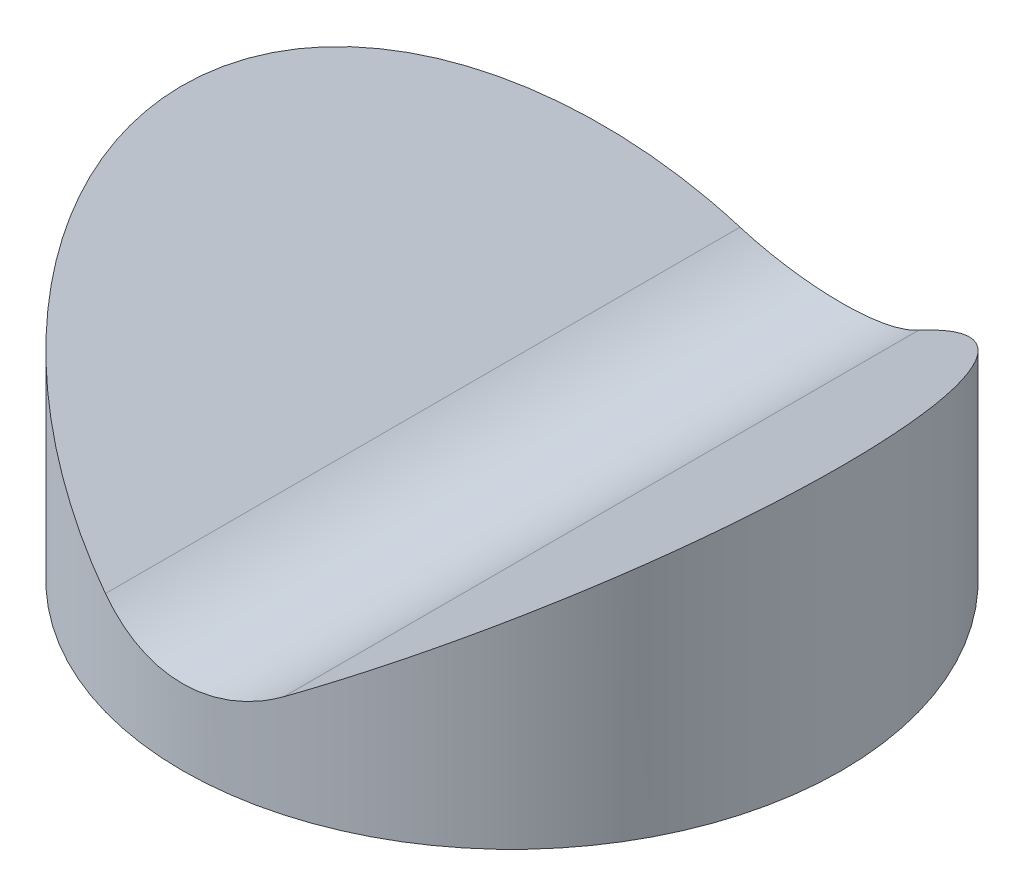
ISO-10303-21;
HEADER;
FILE_DESCRIPTION(('STEP AP214'),'2;1');
FILE_NAME('part.step','',(''),(''),'','','');
FILE_SCHEMA(('AUTOMOTIVE_DESIGN { 1 0 10303 214 1 1 1 1 }'));
ENDSEC;
DATA;
#1=APPLICATION_CONTEXT('core data for automotive mechanical design processes');
#2=APPLICATION_PROTOCOL_DEFINITION('international standard','automotive_design',2000,#1);
#3=PRODUCT_CONTEXT('',#1,'mechanical');
#4=PRODUCT('Part','Part','',(#3));
#5=PRODUCT_RELATED_PRODUCT_CATEGORY('part','',(#4));
#6=PRODUCT_DEFINITION_FORMATION('','',#4);
#7=PRODUCT_DEFINITION_CONTEXT('part definition',#1,'design');
#8=PRODUCT_DEFINITION('design','',#6,#7);
#9=PRODUCT_DEFINITION_SHAPE('','',#8);
#10=(LENGTH_UNIT() NAMED_UNIT(*) SI_UNIT(.MILLI.,.METRE.));
#11=(NAMED_UNIT(*) PLANE_ANGLE_UNIT() SI_UNIT($,.RADIAN.));
#12=(NAMED_UNIT(*) SI_UNIT($,.STERADIAN.) SOLID_ANGLE_UNIT());
#13=UNCERTAINTY_MEASURE_WITH_UNIT(LENGTH_MEASURE(1.E-05),#10,'distance_accuracy_value','');
#14=(GEOMETRIC_REPRESENTATION_CONTEXT(3) GLOBAL_UNCERTAINTY_ASSIGNED_CONTEXT((#13)) GLOBAL_UNIT_ASSIGNED_CONTEXT((#10,
#11,#12)) REPRESENTATION_CONTEXT('',''));
#15=CARTESIAN_POINT('',(0.,0.,0.));
#16=DIRECTION('',(0.,0.,1.));
#17=DIRECTION('',(1.,0.,0.));
#18=AXIS2_PLACEMENT_3D('',#15,#16,#17);
#19=CARTESIAN_POINT('',(0.,0.8,0.));
#20=DIRECTION('',(0.,-1.,0.));
#21=DIRECTION('',(0.,0.,-1.));
#22=AXIS2_PLACEMENT_3D('',#19,#20,#21);
#23=CYLINDRICAL_SURFACE('',#22,3.5);
#24=CARTESIAN_POINT('',(0.,0.452722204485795,0.));
#25=DIRECTION('',(0.556988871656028,-0.830519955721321,0.));
#26=DIRECTION('',(-0.830519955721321,-0.556988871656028,0.));
#27=AXIS2_PLACEMENT_3D('',#24,#25,#26);
#28=ELLIPSE('',#27,4.21422745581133,3.5);
#29=CARTESIAN_POINT('',(0.947883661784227,1.08842113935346,3.36920117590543));
#30=VERTEX_POINT('',#29);
#31=CARTESIAN_POINT('',(0.947883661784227,1.08842113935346,-3.36920117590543));
#32=VERTEX_POINT('',#31);
#33=EDGE_CURVE('E44',#30,#32,#28,.F.);
#34=ORIENTED_EDGE('',*,*,#33,.F.);
#35=CARTESIAN_POINT('',(-0.947883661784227,1.08842113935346,3.36920117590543));
#36=CARTESIAN_POINT('',(-0.910918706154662,1.06363332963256,3.37960174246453));
#37=CARTESIAN_POINT('',(-0.87292444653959,1.04025352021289,3.38963261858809));
#38=CARTESIAN_POINT('',(-0.795018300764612,0.996452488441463,3.40874711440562));
#39=CARTESIAN_POINT('',(-0.755105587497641,0.976032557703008,3.41783032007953));
#40=CARTESIAN_POINT('',(-0.632628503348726,0.919400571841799,3.4433586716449));
#41=CARTESIAN_POINT('',(-0.547437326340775,0.887891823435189,3.45804998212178));
#42=CARTESIAN_POINT('',(-0.372087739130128,0.838671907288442,3.48129247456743));
#43=CARTESIAN_POINT('',(-0.281915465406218,0.821001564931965,3.48982548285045));
#44=CARTESIAN_POINT('',(-0.099657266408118,0.800454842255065,3.49976694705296));
#45=CARTESIAN_POINT('',(-0.00757540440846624,0.797549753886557,3.50118922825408));
#46=CARTESIAN_POINT('',(0.170917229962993,0.806368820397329,3.49690625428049));
#47=CARTESIAN_POINT('',(0.257375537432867,0.81734614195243,3.49156484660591));
#48=CARTESIAN_POINT('',(0.427162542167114,0.852202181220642,3.47488386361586));
#49=CARTESIAN_POINT('',(0.510487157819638,0.876097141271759,3.46353673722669));
#50=CARTESIAN_POINT('',(0.654469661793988,0.929424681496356,3.43886714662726));
#51=CARTESIAN_POINT('',(0.716157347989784,0.956571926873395,3.4264896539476));
#52=CARTESIAN_POINT('',(0.835299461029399,1.0175933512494,3.39941553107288));
#53=CARTESIAN_POINT('',(0.892767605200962,1.0514442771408,3.38472695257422));
#54=CARTESIAN_POINT('',(0.947883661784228,1.08842113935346,3.36920117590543));
#55=B_SPLINE_CURVE_WITH_KNOTS('',3,(#35,#36,#37,#38,#39,#40,#41,#42,#43,#44,#45,#46,#47,#48,#49,
#50,#51,#52,#53,#54),.UNSPECIFIED.,.F.,.F.,(4,2,2,2,2,2,2,2,2,4),(0.,0.137047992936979,
0.274155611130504,0.548783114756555,0.824217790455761,1.09911673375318,1.35983665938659,
1.62088517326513,1.8259701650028,2.03035585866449),.UNSPECIFIED.);
#56=CARTESIAN_POINT('',(-0.947883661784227,1.08842113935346,3.36920117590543));
#57=VERTEX_POINT('',#56);
#58=EDGE_CURVE('E51',#57,#30,#55,.T.);
#59=ORIENTED_EDGE('',*,*,#58,.F.);
#60=CARTESIAN_POINT('',(0.,0.452722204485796,0.));
#61=DIRECTION('',(-0.556988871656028,-0.830519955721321,0.));
#62=DIRECTION('',(0.830519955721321,-0.556988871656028,0.));
#63=AXIS2_PLACEMENT_3D('',#60,#61,#62);
#64=ELLIPSE('',#63,4.21422745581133,3.5);
#65=CARTESIAN_POINT('',(-0.947883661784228,1.08842113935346,-3.36920117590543));
#66=VERTEX_POINT('',#65);
#67=EDGE_CURVE('E65',#66,#57,#64,.F.);
#68=ORIENTED_EDGE('',*,*,#67,.F.);
#69=CARTESIAN_POINT('',(-0.947883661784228,1.08842113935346,-3.36920117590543));
#70=CARTESIAN_POINT('',(-0.910918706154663,1.06363332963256,-3.37960174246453));
#71=CARTESIAN_POINT('',(-0.872924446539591,1.04025352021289,-3.38963261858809));
#72=CARTESIAN_POINT('',(-0.795018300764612,0.996452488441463,-3.40874711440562));
#73=CARTESIAN_POINT('',(-0.755105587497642,0.976032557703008,-3.41783032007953));
#74=CARTESIAN_POINT('',(-0.632628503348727,0.919400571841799,-3.4433586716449));
#75=CARTESIAN_POINT('',(-0.547437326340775,0.88789182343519,-3.45804998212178));
#76=CARTESIAN_POINT('',(-0.372087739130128,0.838671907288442,-3.48129247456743));
#77=CARTESIAN_POINT('',(-0.281915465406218,0.821001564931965,-3.48982548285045));
#78=CARTESIAN_POINT('',(-0.0996572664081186,0.800454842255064,-3.49976694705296));
#79=CARTESIAN_POINT('',(-0.00757540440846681,0.797549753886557,-3.50118922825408));
#80=CARTESIAN_POINT('',(0.170917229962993,0.806368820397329,-3.49690625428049));
#81=CARTESIAN_POINT('',(0.257375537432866,0.81734614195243,-3.49156484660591));
#82=CARTESIAN_POINT('',(0.427162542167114,0.852202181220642,-3.47488386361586));
#83=CARTESIAN_POINT('',(0.510487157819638,0.876097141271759,-3.46353673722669));
#84=CARTESIAN_POINT('',(0.654469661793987,0.929424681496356,-3.43886714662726));
#85=CARTESIAN_POINT('',(0.716157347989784,0.956571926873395,-3.4264896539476));
#86=CARTESIAN_POINT('',(0.835299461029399,1.0175933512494,-3.39941553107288));
#87=CARTESIAN_POINT('',(0.892767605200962,1.0514442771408,-3.38472695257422));
#88=CARTESIAN_POINT('',(0.947883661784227,1.08842113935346,-3.36920117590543));
#89=B_SPLINE_CURVE_WITH_KNOTS('',3,(#69,#70,#71,#72,#73,#74,#75,#76,#77,#78,#79,#80,#81,#82,#83,
#84,#85,#86,#87,#88),.UNSPECIFIED.,.F.,.F.,(4,2,2,2,2,2,2,2,2,4),(0.,0.13704799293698,
0.274155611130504,0.548783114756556,0.824217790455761,1.09911673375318,1.35983665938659,
1.62088517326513,1.8259701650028,2.03035585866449),.UNSPECIFIED.);
#90=EDGE_CURVE('E68',#66,#32,#89,.T.);
#91=ORIENTED_EDGE('',*,*,#90,.T.);
#92=EDGE_LOOP('',(#34,#59,#68,#91));
#93=FACE_BOUND('',#92,.T.);
#94=CARTESIAN_POINT('',(0.,0.,0.));
#95=DIRECTION('',(0.,1.,0.));
#96=DIRECTION('',(0.,0.,1.));
#97=AXIS2_PLACEMENT_3D('',#94,#95,#96);
#98=CIRCLE('',#97,3.5);
#99=CARTESIAN_POINT('',(0.,0.,3.5));
#100=VERTEX_POINT('',#99);
#101=EDGE_CURVE('E11',#100,#100,#98,.T.);
#102=ORIENTED_EDGE('',*,*,#101,.T.);
#103=EDGE_LOOP('',(#102));
#104=FACE_BOUND('',#103,.T.);
#105=ADVANCED_FACE('F36',(#93,#104),#23,.T.);
#106=CARTESIAN_POINT('',(0.,0.,0.));
#107=DIRECTION('',(0.,1.,0.));
#108=DIRECTION('',(0.,0.,1.));
#109=AXIS2_PLACEMENT_3D('',#106,#107,#108);
#110=PLANE('',#109);
#111=ORIENTED_EDGE('',*,*,#101,.F.);
#112=EDGE_LOOP('',(#111));
#113=FACE_BOUND('',#112,.T.);
#114=ADVANCED_FACE('F90',(#113),#110,.F.);
#115=CARTESIAN_POINT('',(0.,2.5018,3.501));
#116=DIRECTION('',(0.,0.,-1.));
#117=DIRECTION('',(-1.,0.,0.));
#118=AXIS2_PLACEMENT_3D('',#115,#116,#117);
#119=CYLINDRICAL_SURFACE('',#118,1.7018);
#120=ORIENTED_EDGE('',*,*,#58,.T.);
#121=DIRECTION('',(0.,0.,-1.));
#122=VECTOR('',#121,1.);
#123=CARTESIAN_POINT('',(0.947883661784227,1.08842113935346,3.501));
#124=LINE('',#123,#122);
#125=EDGE_CURVE('E67',#30,#32,#124,.T.);
#126=ORIENTED_EDGE('',*,*,#125,.T.);
#127=ORIENTED_EDGE('',*,*,#90,.F.);
#128=DIRECTION('',(0.,0.,-1.));
#129=VECTOR('',#128,1.);
#130=CARTESIAN_POINT('',(-0.947883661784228,1.08842113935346,3.501));
#131=LINE('',#130,#129);
#132=EDGE_CURVE('E63',#57,#66,#131,.T.);
#133=ORIENTED_EDGE('',*,*,#132,.F.);
#134=EDGE_LOOP('',(#120,#126,#127,#133));
#135=FACE_BOUND('',#134,.T.);
#136=ADVANCED_FACE('F72',(#135),#119,.F.);
#137=CARTESIAN_POINT('',(-3.5,2.8,3.501));
#138=DIRECTION('',(-0.556988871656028,-0.830519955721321,0.));
#139=DIRECTION('',(0.830519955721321,-0.556988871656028,0.));
#140=AXIS2_PLACEMENT_3D('',#137,#138,#139);
#141=PLANE('',#140);
#142=ORIENTED_EDGE('',*,*,#132,.T.);
#143=ORIENTED_EDGE('',*,*,#67,.T.);
#144=EDGE_LOOP('',(#142,#143));
#145=FACE_BOUND('',#144,.T.);
#146=ADVANCED_FACE('F64',(#145),#141,.F.);
#147=CARTESIAN_POINT('',(3.5,2.8,3.501));
#148=DIRECTION('',(0.556988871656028,-0.830519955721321,0.));
#149=DIRECTION('',(0.830519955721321,0.556988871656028,0.));
#150=AXIS2_PLACEMENT_3D('',#147,#148,#149);
#151=PLANE('',#150);
#152=ORIENTED_EDGE('',*,*,#125,.F.);
#153=ORIENTED_EDGE('',*,*,#33,.T.);
#154=EDGE_LOOP('',(#152,#153));
#155=FACE_BOUND('',#154,.T.);
#156=ADVANCED_FACE('F86',(#155),#151,.F.);
#157=CLOSED_SHELL('',(#105,#114,#136,#146,#156));
#158=MANIFOLD_SOLID_BREP('B2',#157);
#159=ADVANCED_BREP_SHAPE_REPRESENTATION('',(#18,#158),#14);
#160=SHAPE_DEFINITION_REPRESENTATION(#9,#159);
ENDSEC;
END-ISO-10303-21;
